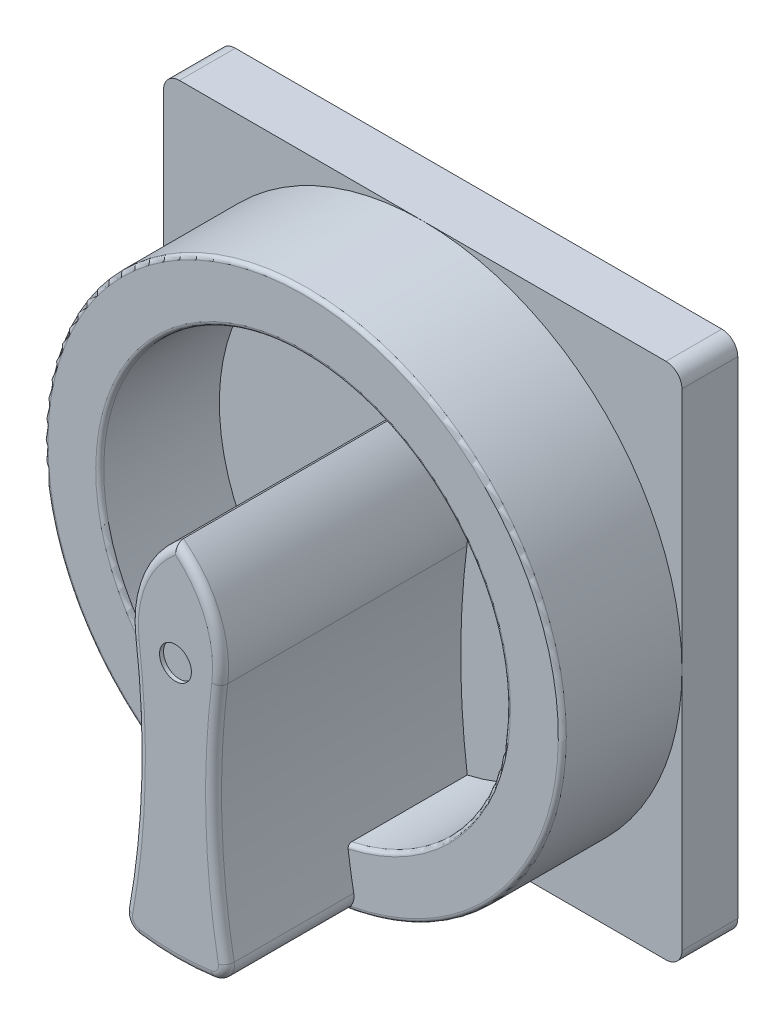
ISO-10303-21;
HEADER;
FILE_DESCRIPTION(('STEP AP214'),'2;1');
FILE_NAME('part.step','',(''),(''),'','','');
FILE_SCHEMA(('AUTOMOTIVE_DESIGN { 1 0 10303 214 1 1 1 1 }'));
ENDSEC;
DATA;
#1=APPLICATION_CONTEXT('core data for automotive mechanical design processes');
#2=APPLICATION_PROTOCOL_DEFINITION('international standard','automotive_design',2000,#1);
#3=PRODUCT_CONTEXT('',#1,'mechanical');
#4=PRODUCT('Part','Part','',(#3));
#5=PRODUCT_RELATED_PRODUCT_CATEGORY('part','',(#4));
#6=PRODUCT_DEFINITION_FORMATION('','',#4);
#7=PRODUCT_DEFINITION_CONTEXT('part definition',#1,'design');
#8=PRODUCT_DEFINITION('design','',#6,#7);
#9=PRODUCT_DEFINITION_SHAPE('','',#8);
#10=(LENGTH_UNIT() NAMED_UNIT(*) SI_UNIT(.MILLI.,.METRE.));
#11=(NAMED_UNIT(*) PLANE_ANGLE_UNIT() SI_UNIT($,.RADIAN.));
#12=(NAMED_UNIT(*) SI_UNIT($,.STERADIAN.) SOLID_ANGLE_UNIT());
#13=UNCERTAINTY_MEASURE_WITH_UNIT(LENGTH_MEASURE(1.E-05),#10,'distance_accuracy_value','');
#14=(GEOMETRIC_REPRESENTATION_CONTEXT(3) GLOBAL_UNCERTAINTY_ASSIGNED_CONTEXT((#13)) GLOBAL_UNIT_ASSIGNED_CONTEXT((#10,
#11,#12)) REPRESENTATION_CONTEXT('',''));
#15=CARTESIAN_POINT('',(0.,0.,0.));
#16=DIRECTION('',(0.,0.,1.));
#17=DIRECTION('',(1.,0.,0.));
#18=AXIS2_PLACEMENT_3D('',#15,#16,#17);
#19=CARTESIAN_POINT('',(-32.5,-32.5,7.));
#20=DIRECTION('',(0.,0.,1.));
#21=DIRECTION('',(1.,0.,0.));
#22=AXIS2_PLACEMENT_3D('',#19,#20,#21);
#23=PLANE('',#22);
#24=DIRECTION('',(0.,1.,0.));
#25=VECTOR('',#24,1.);
#26=CARTESIAN_POINT('',(32.5,32.5,7.));
#27=LINE('',#26,#25);
#28=CARTESIAN_POINT('',(32.5,0.,7.));
#29=VERTEX_POINT('',#28);
#30=CARTESIAN_POINT('',(32.5,30.5,7.));
#31=VERTEX_POINT('',#30);
#32=EDGE_CURVE('E249',#29,#31,#27,.T.);
#33=ORIENTED_EDGE('',*,*,#32,.T.);
#34=CARTESIAN_POINT('',(30.5,30.5,7.));
#35=DIRECTION('',(0.,0.,1.));
#36=DIRECTION('',(1.,0.,0.));
#37=AXIS2_PLACEMENT_3D('',#34,#35,#36);
#38=CIRCLE('',#37,2.);
#39=CARTESIAN_POINT('',(30.5,32.5,7.));
#40=VERTEX_POINT('',#39);
#41=EDGE_CURVE('E11',#31,#40,#38,.T.);
#42=ORIENTED_EDGE('',*,*,#41,.T.);
#43=DIRECTION('',(-1.,0.,0.));
#44=VECTOR('',#43,1.);
#45=CARTESIAN_POINT('',(-32.5,32.5,7.));
#46=LINE('',#45,#44);
#47=CARTESIAN_POINT('',(0.,32.5,7.));
#48=VERTEX_POINT('',#47);
#49=EDGE_CURVE('E253',#40,#48,#46,.T.);
#50=ORIENTED_EDGE('',*,*,#49,.T.);
#51=CARTESIAN_POINT('',(0.,0.,7.));
#52=DIRECTION('',(0.,0.,1.));
#53=DIRECTION('',(1.,0.,0.));
#54=AXIS2_PLACEMENT_3D('',#51,#52,#53);
#55=CIRCLE('',#54,32.5);
#56=EDGE_CURVE('E194',#29,#48,#55,.T.);
#57=ORIENTED_EDGE('',*,*,#56,.F.);
#58=EDGE_LOOP('',(#33,#42,#50,#57));
#59=FACE_BOUND('',#58,.T.);
#60=ADVANCED_FACE('F16',(#59),#23,.T.);
#61=CARTESIAN_POINT('',(-30.5,32.5,7.));
#62=VERTEX_POINT('',#61);
#63=EDGE_CURVE('E252',#48,#62,#46,.T.);
#64=ORIENTED_EDGE('',*,*,#63,.T.);
#65=CARTESIAN_POINT('',(-30.5,30.5,7.));
#66=DIRECTION('',(0.,0.,1.));
#67=DIRECTION('',(1.,0.,0.));
#68=AXIS2_PLACEMENT_3D('',#65,#66,#67);
#69=CIRCLE('',#68,2.);
#70=CARTESIAN_POINT('',(-32.5,30.5,7.));
#71=VERTEX_POINT('',#70);
#72=EDGE_CURVE('E24',#62,#71,#69,.T.);
#73=ORIENTED_EDGE('',*,*,#72,.T.);
#74=DIRECTION('',(0.,-1.,0.));
#75=VECTOR('',#74,1.);
#76=CARTESIAN_POINT('',(-32.5,32.5,7.));
#77=LINE('',#76,#75);
#78=CARTESIAN_POINT('',(-32.5,0.,7.));
#79=VERTEX_POINT('',#78);
#80=EDGE_CURVE('E244',#71,#79,#77,.T.);
#81=ORIENTED_EDGE('',*,*,#80,.T.);
#82=EDGE_CURVE('E231',#48,#79,#55,.T.);
#83=ORIENTED_EDGE('',*,*,#82,.F.);
#84=EDGE_LOOP('',(#64,#73,#81,#83));
#85=FACE_BOUND('',#84,.T.);
#86=ADVANCED_FACE('F444',(#85),#23,.T.);
#87=CARTESIAN_POINT('',(-32.5,-30.5,7.));
#88=VERTEX_POINT('',#87);
#89=EDGE_CURVE('E243',#79,#88,#77,.T.);
#90=ORIENTED_EDGE('',*,*,#89,.T.);
#91=CARTESIAN_POINT('',(-30.5,-30.5,7.));
#92=DIRECTION('',(0.,0.,1.));
#93=DIRECTION('',(1.,0.,0.));
#94=AXIS2_PLACEMENT_3D('',#91,#92,#93);
#95=CIRCLE('',#94,2.);
#96=CARTESIAN_POINT('',(-30.5,-32.5,7.));
#97=VERTEX_POINT('',#96);
#98=EDGE_CURVE('E481',#88,#97,#95,.T.);
#99=ORIENTED_EDGE('',*,*,#98,.T.);
#100=DIRECTION('',(1.,0.,0.));
#101=VECTOR('',#100,1.);
#102=CARTESIAN_POINT('',(-32.5,-32.5,7.));
#103=LINE('',#102,#101);
#104=CARTESIAN_POINT('',(0.,-32.5,7.));
#105=VERTEX_POINT('',#104);
#106=EDGE_CURVE('E247',#97,#105,#103,.T.);
#107=ORIENTED_EDGE('',*,*,#106,.T.);
#108=EDGE_CURVE('E505',#79,#105,#55,.T.);
#109=ORIENTED_EDGE('',*,*,#108,.F.);
#110=EDGE_LOOP('',(#90,#99,#107,#109));
#111=FACE_BOUND('',#110,.T.);
#112=ADVANCED_FACE('F425',(#111),#23,.T.);
#113=CARTESIAN_POINT('',(-32.5,32.5,7.));
#114=DIRECTION('',(1.,0.,0.));
#115=DIRECTION('',(0.,1.,0.));
#116=AXIS2_PLACEMENT_3D('',#113,#114,#115);
#117=PLANE('',#116);
#118=DIRECTION('',(0.,-1.,0.));
#119=VECTOR('',#118,1.);
#120=CARTESIAN_POINT('',(-32.5,32.5,0.));
#121=LINE('',#120,#119);
#122=CARTESIAN_POINT('',(-32.5,30.5,0.));
#123=VERTEX_POINT('',#122);
#124=CARTESIAN_POINT('',(-32.5,-30.5,0.));
#125=VERTEX_POINT('',#124);
#126=EDGE_CURVE('E230',#123,#125,#121,.T.);
#127=ORIENTED_EDGE('',*,*,#126,.T.);
#128=DIRECTION('',(0.,0.,-1.));
#129=VECTOR('',#128,1.);
#130=CARTESIAN_POINT('',(-32.5,-30.5,7.));
#131=LINE('',#130,#129);
#132=EDGE_CURVE('E478',#125,#88,#131,.F.);
#133=ORIENTED_EDGE('',*,*,#132,.T.);
#134=ORIENTED_EDGE('',*,*,#89,.F.);
#135=ORIENTED_EDGE('',*,*,#80,.F.);
#136=DIRECTION('',(0.,0.,-1.));
#137=VECTOR('',#136,1.);
#138=CARTESIAN_POINT('',(-32.5,30.5,7.));
#139=LINE('',#138,#137);
#140=EDGE_CURVE('E473',#71,#123,#139,.T.);
#141=ORIENTED_EDGE('',*,*,#140,.T.);
#142=EDGE_LOOP('',(#127,#133,#134,#135,#141));
#143=FACE_BOUND('',#142,.T.);
#144=ADVANCED_FACE('F421',(#143),#117,.F.);
#145=CARTESIAN_POINT('',(-32.5,-32.5,7.));
#146=DIRECTION('',(0.,1.,0.));
#147=DIRECTION('',(0.,0.,1.));
#148=AXIS2_PLACEMENT_3D('',#145,#146,#147);
#149=PLANE('',#148);
#150=ORIENTED_EDGE('',*,*,#106,.F.);
#151=DIRECTION('',(0.,0.,-1.));
#152=VECTOR('',#151,1.);
#153=CARTESIAN_POINT('',(-30.5,-32.5,7.));
#154=LINE('',#153,#152);
#155=CARTESIAN_POINT('',(-30.5,-32.5,0.));
#156=VERTEX_POINT('',#155);
#157=EDGE_CURVE('E493',#97,#156,#154,.T.);
#158=ORIENTED_EDGE('',*,*,#157,.T.);
#159=DIRECTION('',(1.,0.,0.));
#160=VECTOR('',#159,1.);
#161=CARTESIAN_POINT('',(-32.5,-32.5,0.));
#162=LINE('',#161,#160);
#163=CARTESIAN_POINT('',(30.5,-32.5,0.));
#164=VERTEX_POINT('',#163);
#165=EDGE_CURVE('E235',#156,#164,#162,.T.);
#166=ORIENTED_EDGE('',*,*,#165,.T.);
#167=DIRECTION('',(0.,0.,-1.));
#168=VECTOR('',#167,1.);
#169=CARTESIAN_POINT('',(30.5,-32.5,7.));
#170=LINE('',#169,#168);
#171=CARTESIAN_POINT('',(30.5,-32.5,7.));
#172=VERTEX_POINT('',#171);
#173=EDGE_CURVE('E344',#164,#172,#170,.F.);
#174=ORIENTED_EDGE('',*,*,#173,.T.);
#175=EDGE_CURVE('E246',#105,#172,#103,.T.);
#176=ORIENTED_EDGE('',*,*,#175,.F.);
#177=EDGE_LOOP('',(#150,#158,#166,#174,#176));
#178=FACE_BOUND('',#177,.T.);
#179=ADVANCED_FACE('F417',(#178),#149,.F.);
#180=CARTESIAN_POINT('',(32.5,32.5,7.));
#181=DIRECTION('',(-1.,0.,0.));
#182=DIRECTION('',(0.,0.,1.));
#183=AXIS2_PLACEMENT_3D('',#180,#181,#182);
#184=PLANE('',#183);
#185=CARTESIAN_POINT('',(32.5,-30.5,7.));
#186=VERTEX_POINT('',#185);
#187=EDGE_CURVE('E250',#186,#29,#27,.T.);
#188=ORIENTED_EDGE('',*,*,#187,.F.);
#189=DIRECTION('',(0.,0.,-1.));
#190=VECTOR('',#189,1.);
#191=CARTESIAN_POINT('',(32.5,-30.5,7.));
#192=LINE('',#191,#190);
#193=CARTESIAN_POINT('',(32.5,-30.5,0.));
#194=VERTEX_POINT('',#193);
#195=EDGE_CURVE('E464',#186,#194,#192,.T.);
#196=ORIENTED_EDGE('',*,*,#195,.T.);
#197=DIRECTION('',(0.,1.,0.));
#198=VECTOR('',#197,1.);
#199=CARTESIAN_POINT('',(32.5,32.5,0.));
#200=LINE('',#199,#198);
#201=CARTESIAN_POINT('',(32.5,30.5,0.));
#202=VERTEX_POINT('',#201);
#203=EDGE_CURVE('E238',#194,#202,#200,.T.);
#204=ORIENTED_EDGE('',*,*,#203,.T.);
#205=DIRECTION('',(0.,0.,-1.));
#206=VECTOR('',#205,1.);
#207=CARTESIAN_POINT('',(32.5,30.5,7.));
#208=LINE('',#207,#206);
#209=EDGE_CURVE('E456',#202,#31,#208,.F.);
#210=ORIENTED_EDGE('',*,*,#209,.T.);
#211=ORIENTED_EDGE('',*,*,#32,.F.);
#212=EDGE_LOOP('',(#188,#196,#204,#210,#211));
#213=FACE_BOUND('',#212,.T.);
#214=ADVANCED_FACE('F414',(#213),#184,.F.);
#215=CARTESIAN_POINT('',(-32.5,32.5,7.));
#216=DIRECTION('',(0.,-1.,0.));
#217=DIRECTION('',(0.,0.,-1.));
#218=AXIS2_PLACEMENT_3D('',#215,#216,#217);
#219=PLANE('',#218);
#220=DIRECTION('',(-1.,0.,0.));
#221=VECTOR('',#220,1.);
#222=CARTESIAN_POINT('',(-32.5,32.5,0.));
#223=LINE('',#222,#221);
#224=CARTESIAN_POINT('',(30.5,32.5,0.));
#225=VERTEX_POINT('',#224);
#226=CARTESIAN_POINT('',(-30.5,32.5,0.));
#227=VERTEX_POINT('',#226);
#228=EDGE_CURVE('E241',#225,#227,#223,.T.);
#229=ORIENTED_EDGE('',*,*,#228,.T.);
#230=DIRECTION('',(0.,0.,-1.));
#231=VECTOR('',#230,1.);
#232=CARTESIAN_POINT('',(-30.5,32.5,7.));
#233=LINE('',#232,#231);
#234=EDGE_CURVE('E37',#227,#62,#233,.F.);
#235=ORIENTED_EDGE('',*,*,#234,.T.);
#236=ORIENTED_EDGE('',*,*,#63,.F.);
#237=ORIENTED_EDGE('',*,*,#49,.F.);
#238=DIRECTION('',(0.,0.,-1.));
#239=VECTOR('',#238,1.);
#240=CARTESIAN_POINT('',(30.5,32.5,7.));
#241=LINE('',#240,#239);
#242=EDGE_CURVE('E458',#40,#225,#241,.T.);
#243=ORIENTED_EDGE('',*,*,#242,.T.);
#244=EDGE_LOOP('',(#229,#235,#236,#237,#243));
#245=FACE_BOUND('',#244,.T.);
#246=ADVANCED_FACE('F410',(#245),#219,.F.);
#247=ORIENTED_EDGE('',*,*,#175,.T.);
#248=CARTESIAN_POINT('',(30.5,-30.5,7.));
#249=DIRECTION('',(0.,0.,1.));
#250=DIRECTION('',(1.,0.,0.));
#251=AXIS2_PLACEMENT_3D('',#248,#249,#250);
#252=CIRCLE('',#251,2.);
#253=EDGE_CURVE('E461',#172,#186,#252,.T.);
#254=ORIENTED_EDGE('',*,*,#253,.T.);
#255=ORIENTED_EDGE('',*,*,#187,.T.);
#256=EDGE_CURVE('E232',#105,#29,#55,.T.);
#257=ORIENTED_EDGE('',*,*,#256,.F.);
#258=EDGE_LOOP('',(#247,#254,#255,#257));
#259=FACE_BOUND('',#258,.T.);
#260=ADVANCED_FACE('F406',(#259),#23,.T.);
#261=CARTESIAN_POINT('',(-32.5,-32.5,0.));
#262=DIRECTION('',(0.,0.,1.));
#263=DIRECTION('',(1.,0.,0.));
#264=AXIS2_PLACEMENT_3D('',#261,#262,#263);
#265=PLANE('',#264);
#266=ORIENTED_EDGE('',*,*,#165,.F.);
#267=CARTESIAN_POINT('',(-30.5,-30.5,0.));
#268=DIRECTION('',(0.,0.,1.));
#269=DIRECTION('',(1.,0.,0.));
#270=AXIS2_PLACEMENT_3D('',#267,#268,#269);
#271=CIRCLE('',#270,2.);
#272=EDGE_CURVE('E479',#156,#125,#271,.F.);
#273=ORIENTED_EDGE('',*,*,#272,.T.);
#274=ORIENTED_EDGE('',*,*,#126,.F.);
#275=CARTESIAN_POINT('',(-30.5,30.5,0.));
#276=DIRECTION('',(0.,0.,1.));
#277=DIRECTION('',(1.,0.,0.));
#278=AXIS2_PLACEMENT_3D('',#275,#276,#277);
#279=CIRCLE('',#278,2.);
#280=EDGE_CURVE('E477',#123,#227,#279,.F.);
#281=ORIENTED_EDGE('',*,*,#280,.T.);
#282=ORIENTED_EDGE('',*,*,#228,.F.);
#283=CARTESIAN_POINT('',(30.5,30.5,0.));
#284=DIRECTION('',(0.,0.,1.));
#285=DIRECTION('',(1.,0.,0.));
#286=AXIS2_PLACEMENT_3D('',#283,#284,#285);
#287=CIRCLE('',#286,2.);
#288=EDGE_CURVE('E459',#225,#202,#287,.F.);
#289=ORIENTED_EDGE('',*,*,#288,.T.);
#290=ORIENTED_EDGE('',*,*,#203,.F.);
#291=CARTESIAN_POINT('',(30.5,-30.5,0.));
#292=DIRECTION('',(0.,0.,1.));
#293=DIRECTION('',(1.,0.,0.));
#294=AXIS2_PLACEMENT_3D('',#291,#292,#293);
#295=CIRCLE('',#294,2.);
#296=EDGE_CURVE('E483',#194,#164,#295,.F.);
#297=ORIENTED_EDGE('',*,*,#296,.T.);
#298=EDGE_LOOP('',(#266,#273,#274,#281,#282,#289,#290,#297));
#299=FACE_BOUND('',#298,.T.);
#300=ADVANCED_FACE('F399',(#299),#265,.F.);
#301=CARTESIAN_POINT('',(0.,0.,22.));
#302=DIRECTION('',(0.,0.,1.));
#303=DIRECTION('',(1.,0.,0.));
#304=AXIS2_PLACEMENT_3D('',#301,#302,#303);
#305=PLANE('',#304);
#306=CARTESIAN_POINT('',(-102.745669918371,-12.3032779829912,22.));
#307=DIRECTION('',(0.,0.,-1.));
#308=DIRECTION('',(1.,0.,0.));
#309=AXIS2_PLACEMENT_3D('',#306,#307,#308);
#310=CIRCLE('',#309,97.9758178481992);
#311=CARTESIAN_POINT('',(-5.64637239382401,-25.3794893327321,22.));
#312=VERTEX_POINT('',#311);
#313=CARTESIAN_POINT('',(-6.34951799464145,-29.8259141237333,22.));
#314=VERTEX_POINT('',#313);
#315=EDGE_CURVE('E268',#312,#314,#310,.T.);
#316=ORIENTED_EDGE('',*,*,#315,.F.);
#317=CARTESIAN_POINT('',(0.,0.,22.));
#318=DIRECTION('',(0.,0.,1.));
#319=DIRECTION('',(1.,0.,0.));
#320=AXIS2_PLACEMENT_3D('',#317,#318,#319);
#321=CIRCLE('',#320,26.);
#322=CARTESIAN_POINT('',(5.64637239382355,-25.3794893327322,22.));
#323=VERTEX_POINT('',#322);
#324=EDGE_CURVE('E529',#312,#323,#321,.F.);
#325=ORIENTED_EDGE('',*,*,#324,.T.);
#326=CARTESIAN_POINT('',(102.745669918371,-12.3032779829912,22.));
#327=DIRECTION('',(0.,0.,-1.));
#328=DIRECTION('',(1.,0.,0.));
#329=AXIS2_PLACEMENT_3D('',#326,#327,#328);
#330=CIRCLE('',#329,97.9758178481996);
#331=CARTESIAN_POINT('',(6.34951799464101,-29.8259141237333,22.));
#332=VERTEX_POINT('',#331);
#333=EDGE_CURVE('E210',#332,#323,#330,.T.);
#334=ORIENTED_EDGE('',*,*,#333,.F.);
#335=CARTESIAN_POINT('',(4.38176403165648,-30.1836072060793,22.));
#336=DIRECTION('',(0.,0.,1.));
#337=DIRECTION('',(1.,0.,0.));
#338=AXIS2_PLACEMENT_3D('',#335,#336,#337);
#339=CIRCLE('',#338,2.);
#340=CARTESIAN_POINT('',(5.93379719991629,-31.4450322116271,22.));
#341=VERTEX_POINT('',#340);
#342=EDGE_CURVE('E545',#332,#341,#339,.F.);
#343=ORIENTED_EDGE('',*,*,#342,.T.);
#344=CARTESIAN_POINT('',(0.,0.,22.));
#345=DIRECTION('',(0.,0.,1.));
#346=DIRECTION('',(1.,0.,0.));
#347=AXIS2_PLACEMENT_3D('',#344,#345,#346);
#348=CIRCLE('',#347,32.);
#349=CARTESIAN_POINT('',(-5.93379719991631,-31.4450322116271,22.));
#350=VERTEX_POINT('',#349);
#351=EDGE_CURVE('E266',#341,#350,#348,.T.);
#352=ORIENTED_EDGE('',*,*,#351,.T.);
#353=CARTESIAN_POINT('',(-4.38176403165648,-30.1836072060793,22.));
#354=DIRECTION('',(0.,0.,1.));
#355=DIRECTION('',(1.,0.,0.));
#356=AXIS2_PLACEMENT_3D('',#353,#354,#355);
#357=CIRCLE('',#356,2.);
#358=EDGE_CURVE('E542',#350,#314,#357,.F.);
#359=ORIENTED_EDGE('',*,*,#358,.T.);
#360=EDGE_LOOP('',(#316,#325,#334,#343,#352,#359));
#361=FACE_BOUND('',#360,.T.);
#362=ADVANCED_FACE('F396',(#361),#305,.T.);
#363=CARTESIAN_POINT('',(0.,0.,22.));
#364=DIRECTION('',(0.,0.,-1.));
#365=DIRECTION('',(-1.,0.,0.));
#366=AXIS2_PLACEMENT_3D('',#363,#364,#365);
#367=CYLINDRICAL_SURFACE('',#366,32.5);
#368=DIRECTION('',(0.,0.,-1.));
#369=VECTOR('',#368,1.);
#370=CARTESIAN_POINT('',(-4.66909282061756,-32.1628601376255,22.));
#371=LINE('',#370,#369);
#372=CARTESIAN_POINT('',(-4.66909282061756,-32.1628601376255,37.));
#373=VERTEX_POINT('',#372);
#374=CARTESIAN_POINT('',(-4.66909282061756,-32.1628601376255,21.5));
#375=VERTEX_POINT('',#374);
#376=EDGE_CURVE('E596',#373,#375,#371,.T.);
#377=ORIENTED_EDGE('',*,*,#376,.T.);
#378=CARTESIAN_POINT('',(0.,0.,21.5));
#379=DIRECTION('',(0.,0.,1.));
#380=DIRECTION('',(1.,0.,0.));
#381=AXIS2_PLACEMENT_3D('',#378,#379,#380);
#382=CIRCLE('',#381,32.5);
#383=CARTESIAN_POINT('',(4.66909282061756,-32.1628601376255,21.5));
#384=VERTEX_POINT('',#383);
#385=EDGE_CURVE('E531',#375,#384,#382,.F.);
#386=ORIENTED_EDGE('',*,*,#385,.T.);
#387=DIRECTION('',(0.,0.,-1.));
#388=VECTOR('',#387,1.);
#389=CARTESIAN_POINT('',(4.66909282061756,-32.1628601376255,22.));
#390=LINE('',#389,#388);
#391=CARTESIAN_POINT('',(4.66909282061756,-32.1628601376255,37.));
#392=VERTEX_POINT('',#391);
#393=EDGE_CURVE('E270',#384,#392,#390,.F.);
#394=ORIENTED_EDGE('',*,*,#393,.T.);
#395=CARTESIAN_POINT('',(0.,0.,37.));
#396=DIRECTION('',(0.,0.,1.));
#397=DIRECTION('',(1.,0.,0.));
#398=AXIS2_PLACEMENT_3D('',#395,#396,#397);
#399=CIRCLE('',#398,32.5);
#400=EDGE_CURVE('E575',#392,#373,#399,.F.);
#401=ORIENTED_EDGE('',*,*,#400,.T.);
#402=EDGE_LOOP('',(#377,#386,#394,#401));
#403=FACE_BOUND('',#402,.T.);
#404=ORIENTED_EDGE('',*,*,#56,.T.);
#405=ORIENTED_EDGE('',*,*,#82,.T.);
#406=ORIENTED_EDGE('',*,*,#108,.T.);
#407=ORIENTED_EDGE('',*,*,#256,.T.);
#408=EDGE_LOOP('',(#404,#405,#406,#407));
#409=FACE_BOUND('',#408,.T.);
#410=ADVANCED_FACE('F395',(#403,#409),#367,.T.);
#411=CARTESIAN_POINT('',(-102.745669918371,-12.3032779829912,22.));
#412=DIRECTION('',(0.,0.,-1.));
#413=DIRECTION('',(-1.,0.,0.));
#414=AXIS2_PLACEMENT_3D('',#411,#412,#413);
#415=CYLINDRICAL_SURFACE('',#414,97.9758178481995);
#416=DIRECTION('',(0.,0.,-1.));
#417=VECTOR('',#416,1.);
#418=CARTESIAN_POINT('',(-6.34951799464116,-29.8259141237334,22.));
#419=LINE('',#418,#417);
#420=CARTESIAN_POINT('',(-6.34951799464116,-29.8259141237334,37.));
#421=VERTEX_POINT('',#420);
#422=EDGE_CURVE('E549',#314,#421,#419,.F.);
#423=ORIENTED_EDGE('',*,*,#422,.T.);
#424=CARTESIAN_POINT('',(-102.745669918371,-12.3032779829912,37.));
#425=DIRECTION('',(0.,0.,1.));
#426=DIRECTION('',(1.,0.,0.));
#427=AXIS2_PLACEMENT_3D('',#424,#425,#426);
#428=CIRCLE('',#427,97.9758178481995);
#429=CARTESIAN_POINT('',(-5.54541151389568,0.,37.));
#430=VERTEX_POINT('',#429);
#431=EDGE_CURVE('E190',#421,#430,#428,.T.);
#432=ORIENTED_EDGE('',*,*,#431,.T.);
#433=DIRECTION('',(0.,0.,-1.));
#434=VECTOR('',#433,1.);
#435=CARTESIAN_POINT('',(-5.54541151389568,0.,22.));
#436=LINE('',#435,#434);
#437=CARTESIAN_POINT('',(-5.54541151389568,0.,7.));
#438=VERTEX_POINT('',#437);
#439=EDGE_CURVE('E181',#430,#438,#436,.T.);
#440=ORIENTED_EDGE('',*,*,#439,.T.);
#441=CARTESIAN_POINT('',(-102.745669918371,-12.3032779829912,7.));
#442=DIRECTION('',(0.,0.,1.));
#443=DIRECTION('',(-1.,0.,0.));
#444=AXIS2_PLACEMENT_3D('',#441,#442,#443);
#445=CIRCLE('',#444,97.9758178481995);
#446=CARTESIAN_POINT('',(-5.58065314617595,-24.8818470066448,7.));
#447=VERTEX_POINT('',#446);
#448=EDGE_CURVE('E187',#447,#438,#445,.T.);
#449=ORIENTED_EDGE('',*,*,#448,.F.);
#450=DIRECTION('',(0.,0.,-1.));
#451=VECTOR('',#450,1.);
#452=CARTESIAN_POINT('',(-5.58065314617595,-24.8818470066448,22.));
#453=LINE('',#452,#451);
#454=CARTESIAN_POINT('',(-5.58065314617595,-24.8818470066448,21.5));
#455=VERTEX_POINT('',#454);
#456=EDGE_CURVE('E223',#455,#447,#453,.T.);
#457=ORIENTED_EDGE('',*,*,#456,.F.);
#458=CARTESIAN_POINT('',(-5.58065314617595,-24.8818470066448,21.5));
#459=CARTESIAN_POINT('',(-5.58065035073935,-24.8818227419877,21.5280451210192));
#460=CARTESIAN_POINT('',(-5.58095717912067,-24.8841955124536,21.5560823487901));
#461=CARTESIAN_POINT('',(-5.58216934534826,-24.8935551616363,21.6113373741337));
#462=CARTESIAN_POINT('',(-5.58307413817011,-24.9005378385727,21.6385558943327));
#463=CARTESIAN_POINT('',(-5.58546208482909,-24.9189419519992,21.691435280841));
#464=CARTESIAN_POINT('',(-5.58694549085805,-24.9303653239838,21.7170954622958));
#465=CARTESIAN_POINT('',(-5.59045108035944,-24.9573097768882,21.7661194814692));
#466=CARTESIAN_POINT('',(-5.59247318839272,-24.9728302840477,21.7894836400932));
#467=CARTESIAN_POINT('',(-5.59700840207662,-25.0075589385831,21.8333079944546));
#468=CARTESIAN_POINT('',(-5.59952245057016,-25.0267741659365,21.8537624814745));
#469=CARTESIAN_POINT('',(-5.60497382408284,-25.0683272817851,21.8911472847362));
#470=CARTESIAN_POINT('',(-5.60791123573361,-25.0906658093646,21.9080768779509));
#471=CARTESIAN_POINT('',(-5.61414397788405,-25.1379233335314,21.9379992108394));
#472=CARTESIAN_POINT('',(-5.61744073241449,-25.1628525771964,21.9509754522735));
#473=CARTESIAN_POINT('',(-5.62429334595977,-25.2145045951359,21.9725317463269));
#474=CARTESIAN_POINT('',(-5.6278490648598,-25.2412263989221,21.9811141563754));
#475=CARTESIAN_POINT('',(-5.63391542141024,-25.2866658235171,21.9915751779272));
#476=CARTESIAN_POINT('',(-5.63638241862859,-25.305105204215,21.994732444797));
#477=CARTESIAN_POINT('',(-5.64135490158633,-25.3421905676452,21.9989446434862));
#478=CARTESIAN_POINT('',(-5.64386032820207,-25.3608362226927,22.0000025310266));
#479=CARTESIAN_POINT('',(-5.64637239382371,-25.3794893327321,22.));
#480=B_SPLINE_CURVE_WITH_KNOTS('',3,(#458,#459,#460,#461,#462,#463,#464,#465,#466,#467,#468,
#469,#470,#471,#472,#473,#474,#475,#476,#477,#478,#479),.UNSPECIFIED.,.F.,.F.,(4,2,2,2,2,2,2,2,
2,2,4),(0.,0.0840220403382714,0.167967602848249,0.251949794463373,0.335920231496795,
0.420053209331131,0.504203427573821,0.588700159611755,0.673151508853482,0.7296498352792,
0.786068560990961),.UNSPECIFIED.);
#481=EDGE_CURVE('E367',#455,#312,#480,.T.);
#482=ORIENTED_EDGE('',*,*,#481,.T.);
#483=ORIENTED_EDGE('',*,*,#315,.T.);
#484=EDGE_LOOP('',(#423,#432,#440,#449,#457,#482,#483));
#485=FACE_BOUND('',#484,.T.);
#486=ADVANCED_FACE('F184',(#485),#415,.F.);
#487=CARTESIAN_POINT('',(8.34376693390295,1.75804494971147,22.));
#488=DIRECTION('',(0.,0.,-1.));
#489=DIRECTION('',(-1.,0.,0.));
#490=AXIS2_PLACEMENT_3D('',#487,#488,#489);
#491=CYLINDRICAL_SURFACE('',#490,14.);
#492=ORIENTED_EDGE('',*,*,#439,.F.);
#493=CARTESIAN_POINT('',(8.34376693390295,1.75804494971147,37.));
#494=DIRECTION('',(0.,0.,1.));
#495=DIRECTION('',(1.,0.,0.));
#496=AXIS2_PLACEMENT_3D('',#493,#494,#495);
#497=CIRCLE('',#496,14.);
#498=CARTESIAN_POINT('',(0.,13.,37.));
#499=VERTEX_POINT('',#498);
#500=EDGE_CURVE('E570',#430,#499,#497,.F.);
#501=ORIENTED_EDGE('',*,*,#500,.T.);
#502=DIRECTION('',(0.,0.,-1.));
#503=VECTOR('',#502,1.);
#504=CARTESIAN_POINT('',(0.,13.,22.));
#505=LINE('',#504,#503);
#506=CARTESIAN_POINT('',(0.,13.,7.));
#507=VERTEX_POINT('',#506);
#508=EDGE_CURVE('E195',#499,#507,#505,.T.);
#509=ORIENTED_EDGE('',*,*,#508,.T.);
#510=CARTESIAN_POINT('',(8.34376693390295,1.75804494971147,7.));
#511=DIRECTION('',(0.,0.,-1.));
#512=DIRECTION('',(-1.,0.,0.));
#513=AXIS2_PLACEMENT_3D('',#510,#511,#512);
#514=CIRCLE('',#513,14.);
#515=EDGE_CURVE('E198',#438,#507,#514,.T.);
#516=ORIENTED_EDGE('',*,*,#515,.F.);
#517=EDGE_LOOP('',(#492,#501,#509,#516));
#518=FACE_BOUND('',#517,.T.);
#519=ADVANCED_FACE('F199',(#518),#491,.T.);
#520=CARTESIAN_POINT('',(-8.34376693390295,1.75804494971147,22.));
#521=DIRECTION('',(0.,0.,-1.));
#522=DIRECTION('',(-1.,0.,0.));
#523=AXIS2_PLACEMENT_3D('',#520,#521,#522);
#524=CYLINDRICAL_SURFACE('',#523,14.);
#525=ORIENTED_EDGE('',*,*,#508,.F.);
#526=CARTESIAN_POINT('',(-8.34376693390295,1.75804494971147,37.));
#527=DIRECTION('',(0.,0.,1.));
#528=DIRECTION('',(1.,0.,0.));
#529=AXIS2_PLACEMENT_3D('',#526,#527,#528);
#530=CIRCLE('',#529,14.);
#531=CARTESIAN_POINT('',(5.54541151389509,0.,37.));
#532=VERTEX_POINT('',#531);
#533=EDGE_CURVE('E579',#499,#532,#530,.F.);
#534=ORIENTED_EDGE('',*,*,#533,.T.);
#535=DIRECTION('',(0.,0.,-1.));
#536=VECTOR('',#535,1.);
#537=CARTESIAN_POINT('',(5.54541151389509,0.,22.));
#538=LINE('',#537,#536);
#539=CARTESIAN_POINT('',(5.54541151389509,0.,7.));
#540=VERTEX_POINT('',#539);
#541=EDGE_CURVE('E224',#532,#540,#538,.T.);
#542=ORIENTED_EDGE('',*,*,#541,.T.);
#543=CARTESIAN_POINT('',(-8.34376693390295,1.75804494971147,7.));
#544=DIRECTION('',(0.,0.,-1.));
#545=DIRECTION('',(1.,0.,0.));
#546=AXIS2_PLACEMENT_3D('',#543,#544,#545);
#547=CIRCLE('',#546,14.);
#548=EDGE_CURVE('E204',#507,#540,#547,.T.);
#549=ORIENTED_EDGE('',*,*,#548,.F.);
#550=EDGE_LOOP('',(#525,#534,#542,#549));
#551=FACE_BOUND('',#550,.T.);
#552=ADVANCED_FACE('F386',(#551),#524,.T.);
#553=CARTESIAN_POINT('',(102.745669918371,-12.3032779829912,22.));
#554=DIRECTION('',(0.,0.,-1.));
#555=DIRECTION('',(-1.,0.,0.));
#556=AXIS2_PLACEMENT_3D('',#553,#554,#555);
#557=CYLINDRICAL_SURFACE('',#556,97.9758178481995);
#558=ORIENTED_EDGE('',*,*,#541,.F.);
#559=CARTESIAN_POINT('',(102.745669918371,-12.3032779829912,37.));
#560=DIRECTION('',(0.,0.,1.));
#561=DIRECTION('',(1.,0.,0.));
#562=AXIS2_PLACEMENT_3D('',#559,#560,#561);
#563=CIRCLE('',#562,97.9758178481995);
#564=CARTESIAN_POINT('',(6.34951799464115,-29.8259141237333,37.));
#565=VERTEX_POINT('',#564);
#566=EDGE_CURVE('E267',#532,#565,#563,.T.);
#567=ORIENTED_EDGE('',*,*,#566,.T.);
#568=DIRECTION('',(0.,0.,-1.));
#569=VECTOR('',#568,1.);
#570=CARTESIAN_POINT('',(6.34951799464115,-29.8259141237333,22.));
#571=LINE('',#570,#569);
#572=EDGE_CURVE('E550',#565,#332,#571,.T.);
#573=ORIENTED_EDGE('',*,*,#572,.T.);
#574=ORIENTED_EDGE('',*,*,#333,.T.);
#575=CARTESIAN_POINT('',(5.64637239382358,-25.3794893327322,22.));
#576=CARTESIAN_POINT('',(5.64259274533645,-25.3514265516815,22.0000234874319));
#577=CARTESIAN_POINT('',(5.63882709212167,-25.3233687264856,21.9976133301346));
#578=CARTESIAN_POINT('',(5.6314278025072,-25.2680616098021,21.988099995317));
#579=CARTESIAN_POINT('',(5.62779407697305,-25.240811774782,21.9810000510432));
#580=CARTESIAN_POINT('',(5.62075540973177,-25.1878651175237,21.9622762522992));
#581=CARTESIAN_POINT('',(5.61735058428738,-25.162169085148,21.9506501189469));
#582=CARTESIAN_POINT('',(5.61086460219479,-25.1130824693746,21.9232090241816));
#583=CARTESIAN_POINT('',(5.60778338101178,-25.0896914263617,21.9073949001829));
#584=CARTESIAN_POINT('',(5.60203074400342,-25.0459126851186,21.8720439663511));
#585=CARTESIAN_POINT('',(5.59935875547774,-25.0255207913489,21.8525124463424));
#586=CARTESIAN_POINT('',(5.59448983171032,-24.9882866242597,21.8102579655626));
#587=CARTESIAN_POINT('',(5.59229298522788,-24.9714450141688,21.7875344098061));
#588=CARTESIAN_POINT('',(5.58843980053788,-24.9418594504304,21.7396305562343));
#589=CARTESIAN_POINT('',(5.58678162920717,-24.9291016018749,21.7144589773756));
#590=CARTESIAN_POINT('',(5.58403954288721,-24.9079826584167,21.6623129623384));
#591=CARTESIAN_POINT('',(5.58295525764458,-24.8996187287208,21.6353397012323));
#592=CARTESIAN_POINT('',(5.58166685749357,-24.889675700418,21.5901587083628));
#593=CARTESIAN_POINT('',(5.58128688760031,-24.8867417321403,21.5722424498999));
#594=CARTESIAN_POINT('',(5.58078009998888,-24.8828276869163,21.5362200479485));
#595=CARTESIAN_POINT('',(5.58065292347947,-24.8818448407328,21.5181142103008));
#596=CARTESIAN_POINT('',(5.58065314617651,-24.8818470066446,21.5));
#597=B_SPLINE_CURVE_WITH_KNOTS('',3,(#575,#576,#577,#578,#579,#580,#581,#582,#583,#584,#585,
#586,#587,#588,#589,#590,#591,#592,#593,#594,#595,#596),.UNSPECIFIED.,.F.,.F.,(4,2,2,2,2,2,2,2,
2,2,4),(0.,0.0848365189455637,0.16961461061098,0.254435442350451,0.339239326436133,
0.423923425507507,0.508623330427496,0.593031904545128,0.677385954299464,0.731762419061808,
0.786061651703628),.UNSPECIFIED.);
#598=CARTESIAN_POINT('',(5.58065314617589,-24.8818470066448,21.5));
#599=VERTEX_POINT('',#598);
#600=EDGE_CURVE('E374',#323,#599,#597,.T.);
#601=ORIENTED_EDGE('',*,*,#600,.T.);
#602=DIRECTION('',(0.,0.,-1.));
#603=VECTOR('',#602,1.);
#604=CARTESIAN_POINT('',(5.58065314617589,-24.8818470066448,22.));
#605=LINE('',#604,#603);
#606=CARTESIAN_POINT('',(5.58065314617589,-24.8818470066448,7.));
#607=VERTEX_POINT('',#606);
#608=EDGE_CURVE('E226',#599,#607,#605,.T.);
#609=ORIENTED_EDGE('',*,*,#608,.T.);
#610=CARTESIAN_POINT('',(102.745669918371,-12.3032779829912,7.));
#611=DIRECTION('',(0.,0.,1.));
#612=DIRECTION('',(1.,0.,0.));
#613=AXIS2_PLACEMENT_3D('',#610,#611,#612);
#614=CIRCLE('',#613,97.9758178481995);
#615=EDGE_CURVE('E220',#540,#607,#614,.T.);
#616=ORIENTED_EDGE('',*,*,#615,.F.);
#617=EDGE_LOOP('',(#558,#567,#573,#574,#601,#609,#616));
#618=FACE_BOUND('',#617,.T.);
#619=ADVANCED_FACE('F380',(#618),#557,.F.);
#620=CARTESIAN_POINT('',(0.,0.,22.));
#621=DIRECTION('',(0.,0.,-1.));
#622=DIRECTION('',(-1.,0.,0.));
#623=AXIS2_PLACEMENT_3D('',#620,#621,#622);
#624=CYLINDRICAL_SURFACE('',#623,25.5);
#625=ORIENTED_EDGE('',*,*,#608,.F.);
#626=CARTESIAN_POINT('',(0.,0.,21.5));
#627=DIRECTION('',(0.,0.,1.));
#628=DIRECTION('',(1.,0.,0.));
#629=AXIS2_PLACEMENT_3D('',#626,#627,#628);
#630=CIRCLE('',#629,25.5);
#631=EDGE_CURVE('E263',#599,#455,#630,.T.);
#632=ORIENTED_EDGE('',*,*,#631,.T.);
#633=ORIENTED_EDGE('',*,*,#456,.T.);
#634=CARTESIAN_POINT('',(0.,0.,7.));
#635=DIRECTION('',(0.,0.,1.));
#636=DIRECTION('',(1.,0.,0.));
#637=AXIS2_PLACEMENT_3D('',#634,#635,#636);
#638=CIRCLE('',#637,25.5);
#639=EDGE_CURVE('E209',#607,#447,#638,.T.);
#640=ORIENTED_EDGE('',*,*,#639,.F.);
#641=EDGE_LOOP('',(#625,#632,#633,#640));
#642=FACE_BOUND('',#641,.T.);
#643=ADVANCED_FACE('F385',(#642),#624,.F.);
#644=ORIENTED_EDGE('',*,*,#639,.T.);
#645=ORIENTED_EDGE('',*,*,#448,.T.);
#646=ORIENTED_EDGE('',*,*,#515,.T.);
#647=ORIENTED_EDGE('',*,*,#548,.T.);
#648=ORIENTED_EDGE('',*,*,#615,.T.);
#649=EDGE_LOOP('',(#644,#645,#646,#647,#648));
#650=FACE_BOUND('',#649,.T.);
#651=ADVANCED_FACE('F206',(#650),#23,.T.);
#652=CARTESIAN_POINT('',(0.,1.75804494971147,38.));
#653=DIRECTION('',(0.,0.,1.));
#654=DIRECTION('',(1.,0.,0.));
#655=AXIS2_PLACEMENT_3D('',#652,#653,#654);
#656=PLANE('',#655);
#657=CARTESIAN_POINT('',(0.,0.,38.));
#658=DIRECTION('',(0.,0.,1.));
#659=DIRECTION('',(1.,0.,0.));
#660=AXIS2_PLACEMENT_3D('',#657,#658,#659);
#661=CIRCLE('',#660,2.);
#662=CARTESIAN_POINT('',(2.,0.,38.));
#663=VERTEX_POINT('',#662);
#664=EDGE_CURVE('E606',#663,#663,#661,.T.);
#665=ORIENTED_EDGE('',*,*,#664,.F.);
#666=EDGE_LOOP('',(#665));
#667=FACE_BOUND('',#666,.T.);
#668=CARTESIAN_POINT('',(-8.34376693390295,1.75804494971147,38.));
#669=DIRECTION('',(0.,0.,1.));
#670=DIRECTION('',(1.,0.,0.));
#671=AXIS2_PLACEMENT_3D('',#668,#669,#670);
#672=CIRCLE('',#671,13.);
#673=CARTESIAN_POINT('',(4.55332733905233,0.125574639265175,38.));
#674=VERTEX_POINT('',#673);
#675=CARTESIAN_POINT('',(0.,11.7270746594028,38.));
#676=VERTEX_POINT('',#675);
#677=EDGE_CURVE('E557',#674,#676,#672,.T.);
#678=ORIENTED_EDGE('',*,*,#677,.T.);
#679=CARTESIAN_POINT('',(8.34376693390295,1.75804494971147,38.));
#680=DIRECTION('',(0.,0.,1.));
#681=DIRECTION('',(1.,0.,0.));
#682=AXIS2_PLACEMENT_3D('',#679,#680,#681);
#683=CIRCLE('',#682,13.);
#684=CARTESIAN_POINT('',(-4.55332733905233,0.125574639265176,38.));
#685=VERTEX_POINT('',#684);
#686=EDGE_CURVE('E567',#676,#685,#683,.T.);
#687=ORIENTED_EDGE('',*,*,#686,.T.);
#688=CARTESIAN_POINT('',(-102.745669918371,-12.3032779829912,38.));
#689=DIRECTION('',(0.,0.,1.));
#690=DIRECTION('',(1.,0.,0.));
#691=AXIS2_PLACEMENT_3D('',#688,#689,#690);
#692=CIRCLE('',#691,98.9758178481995);
#693=CARTESIAN_POINT('',(-5.36564101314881,-30.0047606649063,38.));
#694=VERTEX_POINT('',#693);
#695=EDGE_CURVE('E565',#685,#694,#692,.F.);
#696=ORIENTED_EDGE('',*,*,#695,.T.);
#697=CARTESIAN_POINT('',(-4.38176403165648,-30.1836072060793,38.));
#698=DIRECTION('',(0.,0.,1.));
#699=DIRECTION('',(1.,0.,0.));
#700=AXIS2_PLACEMENT_3D('',#697,#698,#699);
#701=CIRCLE('',#700,1.);
#702=CARTESIAN_POINT('',(-4.52542842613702,-31.1732336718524,38.));
#703=VERTEX_POINT('',#702);
#704=EDGE_CURVE('E563',#694,#703,#701,.T.);
#705=ORIENTED_EDGE('',*,*,#704,.T.);
#706=CARTESIAN_POINT('',(0.,0.,38.));
#707=DIRECTION('',(0.,0.,1.));
#708=DIRECTION('',(1.,0.,0.));
#709=AXIS2_PLACEMENT_3D('',#706,#707,#708);
#710=CIRCLE('',#709,31.5);
#711=CARTESIAN_POINT('',(4.52542842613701,-31.1732336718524,38.));
#712=VERTEX_POINT('',#711);
#713=EDGE_CURVE('E561',#703,#712,#710,.T.);
#714=ORIENTED_EDGE('',*,*,#713,.T.);
#715=CARTESIAN_POINT('',(4.38176403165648,-30.1836072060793,38.));
#716=DIRECTION('',(0.,0.,1.));
#717=DIRECTION('',(1.,0.,0.));
#718=AXIS2_PLACEMENT_3D('',#715,#716,#717);
#719=CIRCLE('',#718,1.);
#720=CARTESIAN_POINT('',(5.36564101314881,-30.0047606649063,38.));
#721=VERTEX_POINT('',#720);
#722=EDGE_CURVE('E559',#712,#721,#719,.T.);
#723=ORIENTED_EDGE('',*,*,#722,.T.);
#724=CARTESIAN_POINT('',(102.745669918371,-12.3032779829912,38.));
#725=DIRECTION('',(0.,0.,1.));
#726=DIRECTION('',(1.,0.,0.));
#727=AXIS2_PLACEMENT_3D('',#724,#725,#726);
#728=CIRCLE('',#727,98.9758178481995);
#729=EDGE_CURVE('E552',#721,#674,#728,.F.);
#730=ORIENTED_EDGE('',*,*,#729,.T.);
#731=EDGE_LOOP('',(#678,#687,#696,#705,#714,#723,#730));
#732=FACE_BOUND('',#731,.T.);
#733=ADVANCED_FACE('F514',(#667,#732),#656,.T.);
#734=CARTESIAN_POINT('',(-4.38176403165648,-30.1836072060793,22.));
#735=DIRECTION('',(0.,0.,1.));
#736=DIRECTION('',(1.,0.,0.));
#737=AXIS2_PLACEMENT_3D('',#734,#735,#736);
#738=CYLINDRICAL_SURFACE('',#737,2.);
#739=ORIENTED_EDGE('',*,*,#376,.F.);
#740=CARTESIAN_POINT('',(-4.38176403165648,-30.1836072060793,37.));
#741=DIRECTION('',(0.,0.,1.));
#742=DIRECTION('',(1.,0.,0.));
#743=AXIS2_PLACEMENT_3D('',#740,#741,#742);
#744=CIRCLE('',#743,2.);
#745=EDGE_CURVE('E573',#373,#421,#744,.F.);
#746=ORIENTED_EDGE('',*,*,#745,.T.);
#747=ORIENTED_EDGE('',*,*,#422,.F.);
#748=ORIENTED_EDGE('',*,*,#358,.F.);
#749=CARTESIAN_POINT('',(-5.93379719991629,-31.4450322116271,22.));
#750=CARTESIAN_POINT('',(-5.91263677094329,-31.4710739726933,21.9999884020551));
#751=CARTESIAN_POINT('',(-5.89083946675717,-31.4965476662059,21.9985936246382));
#752=CARTESIAN_POINT('',(-5.84616156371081,-31.5461963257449,21.9934357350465));
#753=CARTESIAN_POINT('',(-5.82328305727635,-31.5703736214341,21.9896770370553));
#754=CARTESIAN_POINT('',(-5.7535611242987,-31.6404854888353,21.9755167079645));
#755=CARTESIAN_POINT('',(-5.7052894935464,-31.6844181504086,21.9622178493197));
#756=CARTESIAN_POINT('',(-5.57919620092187,-31.7885932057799,21.9215600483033));
#757=CARTESIAN_POINT('',(-5.49940507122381,-31.8449544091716,21.8904856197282));
#758=CARTESIAN_POINT('',(-5.33476594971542,-31.944603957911,21.8206369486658));
#759=CARTESIAN_POINT('',(-5.24989405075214,-31.9878235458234,21.7818239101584));
#760=CARTESIAN_POINT('',(-5.08457458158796,-32.0580072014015,21.7036527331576));
#761=CARTESIAN_POINT('',(-5.00441890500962,-32.086086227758,21.6646598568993));
#762=CARTESIAN_POINT('',(-4.8421727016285,-32.1317091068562,21.5851124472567));
#763=CARTESIAN_POINT('',(-4.7600880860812,-32.1492816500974,21.5445624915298));
#764=CARTESIAN_POINT('',(-4.67457407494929,-32.1620586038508,21.5026831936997));
#765=CARTESIAN_POINT('',(-4.67183381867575,-32.162462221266,21.5013415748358));
#766=CARTESIAN_POINT('',(-4.66909282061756,-32.1628601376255,21.5));
#767=B_SPLINE_CURVE_WITH_KNOTS('',3,(#749,#750,#751,#752,#753,#754,#755,#756,#757,#758,#759,
#760,#761,#762,#763,#764,#765,#766),.UNSPECIFIED.,.F.,.F.,(4,2,2,2,2,2,2,2,4),(0.,
0.100566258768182,0.200945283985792,0.400102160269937,0.706017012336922,1.01350592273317,
1.2932467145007,1.57222007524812,1.58145296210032),.UNSPECIFIED.);
#768=EDGE_CURVE('E345',#350,#375,#767,.T.);
#769=ORIENTED_EDGE('',*,*,#768,.T.);
#770=EDGE_LOOP('',(#739,#746,#747,#748,#769));
#771=FACE_BOUND('',#770,.T.);
#772=ADVANCED_FACE('F331',(#771),#738,.T.);
#773=CARTESIAN_POINT('',(4.38176403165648,-30.1836072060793,22.));
#774=DIRECTION('',(0.,0.,1.));
#775=DIRECTION('',(1.,0.,0.));
#776=AXIS2_PLACEMENT_3D('',#773,#774,#775);
#777=CYLINDRICAL_SURFACE('',#776,2.);
#778=ORIENTED_EDGE('',*,*,#572,.F.);
#779=CARTESIAN_POINT('',(4.38176403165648,-30.1836072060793,37.));
#780=DIRECTION('',(0.,0.,1.));
#781=DIRECTION('',(1.,0.,0.));
#782=AXIS2_PLACEMENT_3D('',#779,#780,#781);
#783=CIRCLE('',#782,2.);
#784=EDGE_CURVE('E577',#565,#392,#783,.F.);
#785=ORIENTED_EDGE('',*,*,#784,.T.);
#786=ORIENTED_EDGE('',*,*,#393,.F.);
#787=CARTESIAN_POINT('',(5.93379719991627,-31.4450322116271,22.));
#788=CARTESIAN_POINT('',(5.9126367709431,-31.4710739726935,21.9999884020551));
#789=CARTESIAN_POINT('',(5.89083946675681,-31.4965476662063,21.9985936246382));
#790=CARTESIAN_POINT('',(5.84616156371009,-31.5461963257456,21.9934357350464));
#791=CARTESIAN_POINT('',(5.82328305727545,-31.570373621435,21.9896770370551));
#792=CARTESIAN_POINT('',(5.75356112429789,-31.640485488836,21.9755167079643));
#793=CARTESIAN_POINT('',(5.7052894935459,-31.6844181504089,21.9622178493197));
#794=CARTESIAN_POINT('',(5.57919620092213,-31.7885932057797,21.9215600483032));
#795=CARTESIAN_POINT('',(5.49940507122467,-31.8449544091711,21.8904856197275));
#796=CARTESIAN_POINT('',(5.33476594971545,-31.9446039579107,21.820636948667));
#797=CARTESIAN_POINT('',(5.2498940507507,-31.9878235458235,21.7818239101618));
#798=CARTESIAN_POINT('',(5.08457458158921,-32.0580072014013,21.7036527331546));
#799=CARTESIAN_POINT('',(5.00441890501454,-32.0860862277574,21.6646598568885));
#800=CARTESIAN_POINT('',(4.84217270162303,-32.131709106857,21.5851124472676));
#801=CARTESIAN_POINT('',(4.76008808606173,-32.1492816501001,21.5445624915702));
#802=CARTESIAN_POINT('',(4.67457407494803,-32.162058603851,21.5026831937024));
#803=CARTESIAN_POINT('',(4.6718338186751,-32.1624622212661,21.5013415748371));
#804=CARTESIAN_POINT('',(4.66909282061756,-32.1628601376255,21.5));
#805=B_SPLINE_CURVE_WITH_KNOTS('',3,(#787,#788,#789,#790,#791,#792,#793,#794,#795,#796,#797,
#798,#799,#800,#801,#802,#803,#804),.UNSPECIFIED.,.F.,.F.,(4,2,2,2,2,2,2,2,4),(0.,
0.100566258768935,0.200945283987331,0.400102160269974,0.706017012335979,1.01350592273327,
1.29324671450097,1.57222007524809,1.58145296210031),.UNSPECIFIED.);
#806=EDGE_CURVE('E336',#384,#341,#805,.F.);
#807=ORIENTED_EDGE('',*,*,#806,.T.);
#808=ORIENTED_EDGE('',*,*,#342,.F.);
#809=EDGE_LOOP('',(#778,#785,#786,#807,#808));
#810=FACE_BOUND('',#809,.T.);
#811=ADVANCED_FACE('F326',(#810),#777,.T.);
#812=CARTESIAN_POINT('',(4.38176403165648,-30.1836072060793,37.));
#813=DIRECTION('',(0.,0.,1.));
#814=DIRECTION('',(1.,0.,0.));
#815=AXIS2_PLACEMENT_3D('',#812,#813,#814);
#816=DEGENERATE_TOROIDAL_SURFACE('',#815,1.,1.,.T.);
#817=CARTESIAN_POINT('',(5.36564101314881,-30.0047606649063,37.));
#818=DIRECTION('',(-0.178846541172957,0.983876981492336,0.));
#819=DIRECTION('',(-0.983876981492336,-0.178846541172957,0.));
#820=AXIS2_PLACEMENT_3D('',#817,#818,#819);
#821=CIRCLE('',#820,1.);
#822=EDGE_CURVE('E276',#721,#565,#821,.T.);
#823=ORIENTED_EDGE('',*,*,#822,.F.);
#824=ORIENTED_EDGE('',*,*,#722,.F.);
#825=CARTESIAN_POINT('',(4.52542842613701,-31.1732336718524,37.));
#826=DIRECTION('',(-0.989626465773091,-0.14366439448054,0.));
#827=DIRECTION('',(0.14366439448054,-0.989626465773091,0.));
#828=AXIS2_PLACEMENT_3D('',#825,#826,#827);
#829=CIRCLE('',#828,1.);
#830=EDGE_CURVE('E213',#392,#712,#829,.T.);
#831=ORIENTED_EDGE('',*,*,#830,.F.);
#832=ORIENTED_EDGE('',*,*,#784,.F.);
#833=EDGE_LOOP('',(#823,#824,#831,#832));
#834=FACE_BOUND('',#833,.T.);
#835=ADVANCED_FACE('F322',(#834),#816,.T.);
#836=CARTESIAN_POINT('',(0.,0.,37.));
#837=DIRECTION('',(0.,0.,1.));
#838=DIRECTION('',(1.,0.,0.));
#839=AXIS2_PLACEMENT_3D('',#836,#837,#838);
#840=TOROIDAL_SURFACE('',#839,31.5,1.);
#841=ORIENTED_EDGE('',*,*,#830,.T.);
#842=ORIENTED_EDGE('',*,*,#713,.F.);
#843=CARTESIAN_POINT('',(-4.52542842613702,-31.1732336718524,37.));
#844=DIRECTION('',(-0.989626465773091,0.14366439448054,0.));
#845=DIRECTION('',(-0.14366439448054,-0.989626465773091,0.));
#846=AXIS2_PLACEMENT_3D('',#843,#844,#845);
#847=CIRCLE('',#846,1.);
#848=EDGE_CURVE('E279',#373,#703,#847,.T.);
#849=ORIENTED_EDGE('',*,*,#848,.F.);
#850=ORIENTED_EDGE('',*,*,#400,.F.);
#851=EDGE_LOOP('',(#841,#842,#849,#850));
#852=FACE_BOUND('',#851,.T.);
#853=ADVANCED_FACE('F318',(#852),#840,.T.);
#854=CARTESIAN_POINT('',(102.745669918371,-12.3032779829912,37.));
#855=DIRECTION('',(0.,0.,1.));
#856=DIRECTION('',(1.,0.,0.));
#857=AXIS2_PLACEMENT_3D('',#854,#855,#856);
#858=TOROIDAL_SURFACE('',#857,98.9758178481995,1.);
#859=ORIENTED_EDGE('',*,*,#822,.T.);
#860=ORIENTED_EDGE('',*,*,#566,.F.);
#861=CARTESIAN_POINT('',(4.55332733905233,0.125574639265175,37.));
#862=DIRECTION('',(0.125574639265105,0.992084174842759,0.));
#863=DIRECTION('',(-0.992084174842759,0.125574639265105,0.));
#864=AXIS2_PLACEMENT_3D('',#861,#862,#863);
#865=CIRCLE('',#864,1.);
#866=EDGE_CURVE('E282',#674,#532,#865,.T.);
#867=ORIENTED_EDGE('',*,*,#866,.F.);
#868=ORIENTED_EDGE('',*,*,#729,.F.);
#869=EDGE_LOOP('',(#859,#860,#867,#868));
#870=FACE_BOUND('',#869,.T.);
#871=ADVANCED_FACE('F314',(#870),#858,.T.);
#872=CARTESIAN_POINT('',(-4.38176403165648,-30.1836072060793,37.));
#873=DIRECTION('',(0.,0.,1.));
#874=DIRECTION('',(1.,0.,0.));
#875=AXIS2_PLACEMENT_3D('',#872,#873,#874);
#876=DEGENERATE_TOROIDAL_SURFACE('',#875,1.,1.,.T.);
#877=ORIENTED_EDGE('',*,*,#848,.T.);
#878=ORIENTED_EDGE('',*,*,#704,.F.);
#879=CARTESIAN_POINT('',(-5.36564101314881,-30.0047606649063,37.));
#880=DIRECTION('',(0.178846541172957,0.983876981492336,0.));
#881=DIRECTION('',(-0.983876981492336,0.178846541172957,0.));
#882=AXIS2_PLACEMENT_3D('',#879,#880,#881);
#883=CIRCLE('',#882,1.);
#884=EDGE_CURVE('E285',#421,#694,#883,.T.);
#885=ORIENTED_EDGE('',*,*,#884,.F.);
#886=ORIENTED_EDGE('',*,*,#745,.F.);
#887=EDGE_LOOP('',(#877,#878,#885,#886));
#888=FACE_BOUND('',#887,.T.);
#889=ADVANCED_FACE('F311',(#888),#876,.T.);
#890=CARTESIAN_POINT('',(-8.34376693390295,1.75804494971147,37.));
#891=DIRECTION('',(0.,0.,1.));
#892=DIRECTION('',(1.,0.,0.));
#893=AXIS2_PLACEMENT_3D('',#890,#891,#892);
#894=TOROIDAL_SURFACE('',#893,13.,1.);
#895=ORIENTED_EDGE('',*,*,#866,.T.);
#896=ORIENTED_EDGE('',*,*,#533,.F.);
#897=CARTESIAN_POINT('',(0.,13.,37.));
#898=CARTESIAN_POINT('',(0.,13.0000024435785,37.0241272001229));
#899=CARTESIAN_POINT('',(0.,12.9989117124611,37.0482411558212));
#900=CARTESIAN_POINT('',(0.,12.994578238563,37.0962641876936));
#901=CARTESIAN_POINT('',(0.,12.9913364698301,37.1201733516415));
#902=CARTESIAN_POINT('',(0.,12.97848982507,37.1910542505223));
#903=CARTESIAN_POINT('',(0.,12.9657625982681,37.2374935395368));
#904=CARTESIAN_POINT('',(0.,12.9327217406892,37.3274581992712));
#905=CARTESIAN_POINT('',(0.,12.9124186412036,37.3709875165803));
#906=CARTESIAN_POINT('',(0.,12.8652221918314,37.4543508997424));
#907=CARTESIAN_POINT('',(0.,12.8383210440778,37.4941805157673));
#908=CARTESIAN_POINT('',(0.,12.777106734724,37.5719699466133));
#909=CARTESIAN_POINT('',(0.,12.7424237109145,37.6096367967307));
#910=CARTESIAN_POINT('',(0.,12.6681302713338,37.6797075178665));
#911=CARTESIAN_POINT('',(0.,12.6285185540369,37.7121099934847));
#912=CARTESIAN_POINT('',(0.,12.5377815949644,37.7770806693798));
#913=CARTESIAN_POINT('',(0.,12.4858831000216,37.8085666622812));
#914=CARTESIAN_POINT('',(0.,12.3782587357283,37.8641494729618));
#915=CARTESIAN_POINT('',(0.,12.3225289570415,37.8882386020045));
#916=CARTESIAN_POINT('',(0.,12.196274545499,37.9336472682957));
#917=CARTESIAN_POINT('',(0.,12.1251393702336,37.9532660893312));
#918=CARTESIAN_POINT('',(0.,11.9809296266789,37.9823895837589));
#919=CARTESIAN_POINT('',(0.,11.9078570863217,37.9919044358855));
#920=CARTESIAN_POINT('',(0.,11.8008710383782,37.9987322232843));
#921=CARTESIAN_POINT('',(0.,11.7671608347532,37.9998616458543));
#922=CARTESIAN_POINT('',(0.,11.7313243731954,37.9999960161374));
#923=CARTESIAN_POINT('',(0.,11.7291995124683,37.9999999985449));
#924=CARTESIAN_POINT('',(0.,11.7270746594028,38.));
#925=B_SPLINE_CURVE_WITH_KNOTS('',3,(#897,#898,#899,#900,#901,#902,#903,#904,#905,#906,#907,
#908,#909,#910,#911,#912,#913,#914,#915,#916,#917,#918,#919,#920,#921,#922,#923,#924),
.UNSPECIFIED.,.F.,.F.,(4,2,2,2,2,2,2,2,2,2,2,2,2,4),(0.,0.0723314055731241,0.144630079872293,
0.288298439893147,0.431767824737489,0.575407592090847,0.728447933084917,0.881528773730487,
1.06297991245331,1.24461902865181,1.46519605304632,1.68555065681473,1.78668570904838,
1.79306028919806),.UNSPECIFIED.);
#926=EDGE_CURVE('E288',#676,#499,#925,.F.);
#927=ORIENTED_EDGE('',*,*,#926,.F.);
#928=ORIENTED_EDGE('',*,*,#677,.F.);
#929=EDGE_LOOP('',(#895,#896,#927,#928));
#930=FACE_BOUND('',#929,.T.);
#931=ADVANCED_FACE('F298',(#930),#894,.T.);
#932=CARTESIAN_POINT('',(-102.745669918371,-12.3032779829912,37.));
#933=DIRECTION('',(0.,0.,1.));
#934=DIRECTION('',(1.,0.,0.));
#935=AXIS2_PLACEMENT_3D('',#932,#933,#934);
#936=TOROIDAL_SURFACE('',#935,98.9758178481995,1.);
#937=ORIENTED_EDGE('',*,*,#884,.T.);
#938=ORIENTED_EDGE('',*,*,#695,.F.);
#939=CARTESIAN_POINT('',(-4.55332733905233,0.125574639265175,37.));
#940=DIRECTION('',(-0.125574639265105,0.992084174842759,0.));
#941=DIRECTION('',(-0.992084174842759,-0.125574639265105,0.));
#942=AXIS2_PLACEMENT_3D('',#939,#940,#941);
#943=CIRCLE('',#942,1.);
#944=EDGE_CURVE('E296',#430,#685,#943,.T.);
#945=ORIENTED_EDGE('',*,*,#944,.F.);
#946=ORIENTED_EDGE('',*,*,#431,.F.);
#947=EDGE_LOOP('',(#937,#938,#945,#946));
#948=FACE_BOUND('',#947,.T.);
#949=ADVANCED_FACE('F306',(#948),#936,.T.);
#950=CARTESIAN_POINT('',(8.34376693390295,1.75804494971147,37.));
#951=DIRECTION('',(0.,0.,1.));
#952=DIRECTION('',(1.,0.,0.));
#953=AXIS2_PLACEMENT_3D('',#950,#951,#952);
#954=TOROIDAL_SURFACE('',#953,13.,1.);
#955=ORIENTED_EDGE('',*,*,#926,.T.);
#956=ORIENTED_EDGE('',*,*,#500,.F.);
#957=ORIENTED_EDGE('',*,*,#944,.T.);
#958=ORIENTED_EDGE('',*,*,#686,.F.);
#959=EDGE_LOOP('',(#955,#956,#957,#958));
#960=FACE_BOUND('',#959,.T.);
#961=ADVANCED_FACE('F301',(#960),#954,.T.);
#962=CARTESIAN_POINT('',(0.,0.,37.5));
#963=DIRECTION('',(0.,0.,1.));
#964=DIRECTION('',(1.,0.,0.));
#965=AXIS2_PLACEMENT_3D('',#962,#963,#964);
#966=CYLINDRICAL_SURFACE('',#965,2.);
#967=CARTESIAN_POINT('',(0.,0.,37.5));
#968=DIRECTION('',(0.,0.,1.));
#969=DIRECTION('',(1.,0.,0.));
#970=AXIS2_PLACEMENT_3D('',#967,#968,#969);
#971=CIRCLE('',#970,2.);
#972=CARTESIAN_POINT('',(2.,0.,37.5));
#973=VERTEX_POINT('',#972);
#974=EDGE_CURVE('E604',#973,#973,#971,.T.);
#975=ORIENTED_EDGE('',*,*,#974,.F.);
#976=EDGE_LOOP('',(#975));
#977=FACE_BOUND('',#976,.T.);
#978=ORIENTED_EDGE('',*,*,#664,.T.);
#979=EDGE_LOOP('',(#978));
#980=FACE_BOUND('',#979,.T.);
#981=ADVANCED_FACE('F305',(#977,#980),#966,.F.);
#982=CARTESIAN_POINT('',(0.,0.,37.5));
#983=DIRECTION('',(0.,0.,1.));
#984=DIRECTION('',(1.,0.,0.));
#985=AXIS2_PLACEMENT_3D('',#982,#983,#984);
#986=PLANE('',#985);
#987=ORIENTED_EDGE('',*,*,#974,.T.);
#988=EDGE_LOOP('',(#987));
#989=FACE_BOUND('',#988,.T.);
#990=ADVANCED_FACE('F363',(#989),#986,.T.);
#991=CARTESIAN_POINT('',(0.,0.,21.5));
#992=DIRECTION('',(0.,0.,1.));
#993=DIRECTION('',(1.,0.,0.));
#994=AXIS2_PLACEMENT_3D('',#991,#992,#993);
#995=TOROIDAL_SURFACE('',#994,26.,0.5);
#996=ORIENTED_EDGE('',*,*,#600,.F.);
#997=ORIENTED_EDGE('',*,*,#324,.F.);
#998=ORIENTED_EDGE('',*,*,#481,.F.);
#999=ORIENTED_EDGE('',*,*,#631,.F.);
#1000=EDGE_LOOP('',(#996,#997,#998,#999));
#1001=FACE_BOUND('',#1000,.T.);
#1002=ADVANCED_FACE('F357',(#1001),#995,.T.);
#1003=CARTESIAN_POINT('',(0.,0.,21.5));
#1004=DIRECTION('',(0.,0.,1.));
#1005=DIRECTION('',(1.,0.,0.));
#1006=AXIS2_PLACEMENT_3D('',#1003,#1004,#1005);
#1007=TOROIDAL_SURFACE('',#1006,32.,0.5);
#1008=ORIENTED_EDGE('',*,*,#806,.F.);
#1009=ORIENTED_EDGE('',*,*,#385,.F.);
#1010=ORIENTED_EDGE('',*,*,#768,.F.);
#1011=ORIENTED_EDGE('',*,*,#351,.F.);
#1012=EDGE_LOOP('',(#1008,#1009,#1010,#1011));
#1013=FACE_BOUND('',#1012,.T.);
#1014=ADVANCED_FACE('F352',(#1013),#1007,.T.);
#1015=CARTESIAN_POINT('',(-30.5,-30.5,7.));
#1016=DIRECTION('',(0.,0.,-1.));
#1017=DIRECTION('',(-1.,0.,0.));
#1018=AXIS2_PLACEMENT_3D('',#1015,#1016,#1017);
#1019=CYLINDRICAL_SURFACE('',#1018,2.);
#1020=ORIENTED_EDGE('',*,*,#98,.F.);
#1021=ORIENTED_EDGE('',*,*,#132,.F.);
#1022=ORIENTED_EDGE('',*,*,#272,.F.);
#1023=ORIENTED_EDGE('',*,*,#157,.F.);
#1024=EDGE_LOOP('',(#1020,#1021,#1022,#1023));
#1025=FACE_BOUND('',#1024,.T.);
#1026=ADVANCED_FACE('F356',(#1025),#1019,.T.);
#1027=CARTESIAN_POINT('',(30.5,-30.5,7.));
#1028=DIRECTION('',(0.,0.,-1.));
#1029=DIRECTION('',(-1.,0.,0.));
#1030=AXIS2_PLACEMENT_3D('',#1027,#1028,#1029);
#1031=CYLINDRICAL_SURFACE('',#1030,2.);
#1032=ORIENTED_EDGE('',*,*,#253,.F.);
#1033=ORIENTED_EDGE('',*,*,#173,.F.);
#1034=ORIENTED_EDGE('',*,*,#296,.F.);
#1035=ORIENTED_EDGE('',*,*,#195,.F.);
#1036=EDGE_LOOP('',(#1032,#1033,#1034,#1035));
#1037=FACE_BOUND('',#1036,.T.);
#1038=ADVANCED_FACE('F429',(#1037),#1031,.T.);
#1039=CARTESIAN_POINT('',(-30.5,30.5,7.));
#1040=DIRECTION('',(0.,0.,-1.));
#1041=DIRECTION('',(-1.,0.,0.));
#1042=AXIS2_PLACEMENT_3D('',#1039,#1040,#1041);
#1043=CYLINDRICAL_SURFACE('',#1042,2.);
#1044=ORIENTED_EDGE('',*,*,#72,.F.);
#1045=ORIENTED_EDGE('',*,*,#234,.F.);
#1046=ORIENTED_EDGE('',*,*,#280,.F.);
#1047=ORIENTED_EDGE('',*,*,#140,.F.);
#1048=EDGE_LOOP('',(#1044,#1045,#1046,#1047));
#1049=FACE_BOUND('',#1048,.T.);
#1050=ADVANCED_FACE('F432',(#1049),#1043,.T.);
#1051=CARTESIAN_POINT('',(30.5,30.5,7.));
#1052=DIRECTION('',(0.,0.,-1.));
#1053=DIRECTION('',(-1.,0.,0.));
#1054=AXIS2_PLACEMENT_3D('',#1051,#1052,#1053);
#1055=CYLINDRICAL_SURFACE('',#1054,2.);
#1056=ORIENTED_EDGE('',*,*,#41,.F.);
#1057=ORIENTED_EDGE('',*,*,#209,.F.);
#1058=ORIENTED_EDGE('',*,*,#288,.F.);
#1059=ORIENTED_EDGE('',*,*,#242,.F.);
#1060=EDGE_LOOP('',(#1056,#1057,#1058,#1059));
#1061=FACE_BOUND('',#1060,.T.);
#1062=ADVANCED_FACE('F18',(#1061),#1055,.T.);
#1063=CLOSED_SHELL('',(#60,#86,#112,#144,#179,#214,#246,#260,#300,#362,#410,#486,#519,#552,#619,
#643,#651,#733,#772,#811,#835,#853,#871,#889,#931,#949,#961,#981,#990,#1002,#1014,#1026,#1038,
#1050,#1062));
#1064=MANIFOLD_SOLID_BREP('B1',#1063);
#1065=ADVANCED_BREP_SHAPE_REPRESENTATION('',(#18,#1064),#14);
#1066=SHAPE_DEFINITION_REPRESENTATION(#9,#1065);
ENDSEC;
END-ISO-10303-21;
